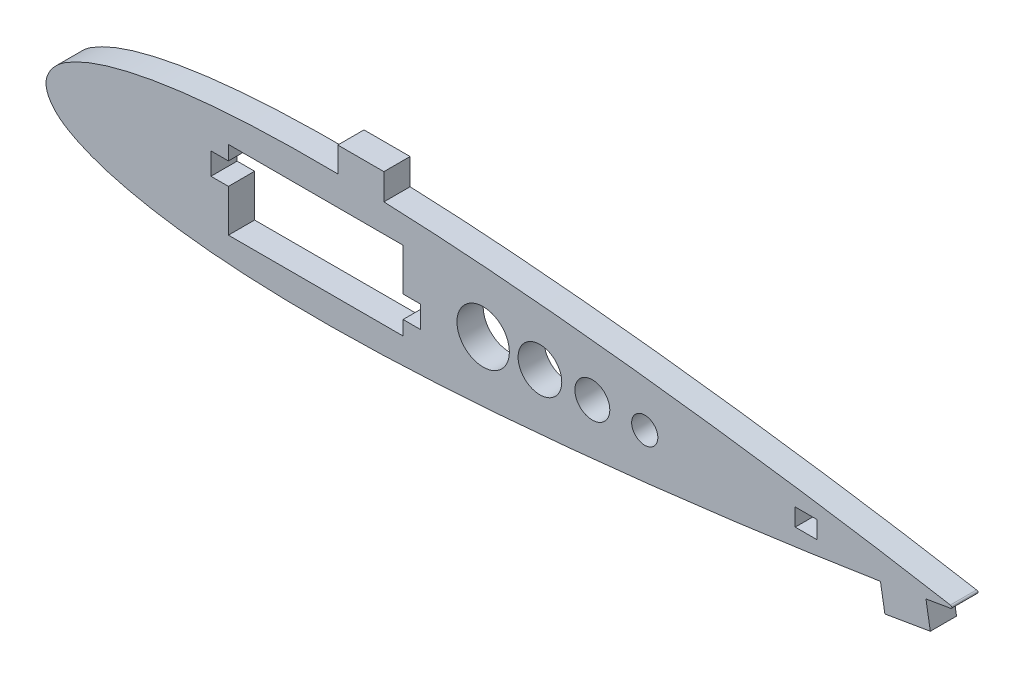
from build123d import *

# Parameters (mm, degrees)
SALIENTE_EXTRUIR1_DEPTH = 3
CROQUIS3_R              = 3
CROQUIS3_R_2            = 2.5
CROQUIS3_R_3            = 2
CROQUIS3_R_4            = 1.5
CROQUIS3_W              = 2.52
CROQUIS3_H              = 2
CORTAR_EXTRUIR1_DEPTH   = 10


with BuildPart() as part:
    # Croquis1 → Saliente-Extruir1 (new body)
    with BuildSketch(Plane.XY):
        with BuildLine():
            Line((91.995911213, -1.498990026), (92.503078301, -4.480099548))
            Line((92.503078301, -4.480099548), (97.708287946, -3.594553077))
            Line((97.708287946, -3.594553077), (97.205136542, -0.637047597))
            add(Edge.make_bspline(
                [(97.205136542, -0.637047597), (98.136950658, -0.478520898), (99.068475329, -0.318260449), (100, -0.158)],
                knots=[0.986199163, 0.986199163, 0.986199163, 0.986199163, 1, 1, 1, 1], degree=3))
            ThreePointArc((100, -0.158), (100.16636323, 0), (100, 0.158))
            add(Edge.make_bspline(
                [(100, 0.158), (98.275203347, 0.456979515), (94.82827065, 1.054477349), (87.930256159, 2.165887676), (79.306950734, 3.442678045), (68.953328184, 4.804419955), (58.600483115, 5.987376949), (48.247255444, 6.956625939), (40.425392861, 7.479599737), (36.056405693, 7.666840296), (35.143031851, 7.700855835)],
                knots=[0, 0, 0, 0, 0.024684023, 0.04932997, 0.098522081, 0.147602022, 0.196578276, 0.24545048, 0.2942189, 0.307105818, 0.307105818, 0.307105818, 0.307105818], degree=3))
            Line((35.143031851, 7.700855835), (35.143031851, 10.700855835))
            Line((35.143031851, 10.700855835), (29.863031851, 10.700855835))
            Line((29.863031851, 10.700855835), (29.863031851, 7.836454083))
            add(Edge.make_bspline(
                [(29.863031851, 7.836454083), (29.084854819, 7.846864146), (26.580634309, 7.865916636), (22.348186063, 7.813551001), (17.164843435, 7.563959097), (11.974100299, 7.077642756), (7.652306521, 6.393060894), (4.200450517, 5.576907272), (1.579309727, 4.757404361), (-0.624643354, 3.7615495), (-2.603561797, 2.442607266), (-4.140304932, 0.125949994), (-2.609419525, -2.194582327), (-0.633839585, -3.518519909), (1.567590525, -4.519939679), (4.186652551, -5.346062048), (7.636435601, -6.170933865), (11.956486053, -6.866432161), (17.14598399, -7.36586089), (22.328679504, -7.62854724), (29.235442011, -7.731453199), (37.872896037, -7.503248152), (48.229831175, -6.837056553), (58.585474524, -5.893967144), (68.941275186, -4.737169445), (79.298305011, -3.401589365), (86.98072604, -2.283936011), (91.211865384, -1.623249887), (91.995911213, -1.498990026)],
                knots=[0.331930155, 0.331930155, 0.331930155, 0.331930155, 0.342903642, 0.367241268, 0.391607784, 0.416059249, 0.440726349, 0.453242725, 0.466028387, 0.479472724, 0.486972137, 0.5, 0.513027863, 0.520527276, 0.533971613, 0.546757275, 0.559273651, 0.583940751, 0.608392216, 0.632758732, 0.657096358, 0.7057811, 0.75454952, 0.803421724, 0.852397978, 0.901477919, 0.95067003, 0.961863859, 0.961863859, 0.961863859, 0.961863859], degree=3))
        make_face()
    extrude(amount=SALIENTE_EXTRUIR1_DEPTH)

    # Croquis3 → Cortar-Extruir1 (cut)
    with BuildSketch(Plane.XY.offset(3)):
        with Locations((46.508153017, 0)):
            Circle(CROQUIS3_R)
        with Locations((53.008153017, 0)):
            Circle(CROQUIS3_R_2)
        with Locations((59.008153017, 0)):
            Circle(CROQUIS3_R_3)
        with Locations((65.008153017, 0)):
            Circle(CROQUIS3_R_4)
        with Locations((83.499696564, 0)):
            Rectangle(CROQUIS3_W, CROQUIS3_H)
        Polygon((17.34148635, 4.5), (37.34148635, 4.5), (37.34148635, -0.34), (39.34148635, -0.34), (39.34148635, -2.86), (37.34148635, -2.86), (37.34148635, -4.5), (17.34148635, -4.5), (17.34148635, 0.34), (15.34148635, 0.34), (15.34148635, 2.86), (17.34148635, 2.86), align=None)
    extrude(amount=-CORTAR_EXTRUIR1_DEPTH, mode=Mode.SUBTRACT)


solid = part.part
